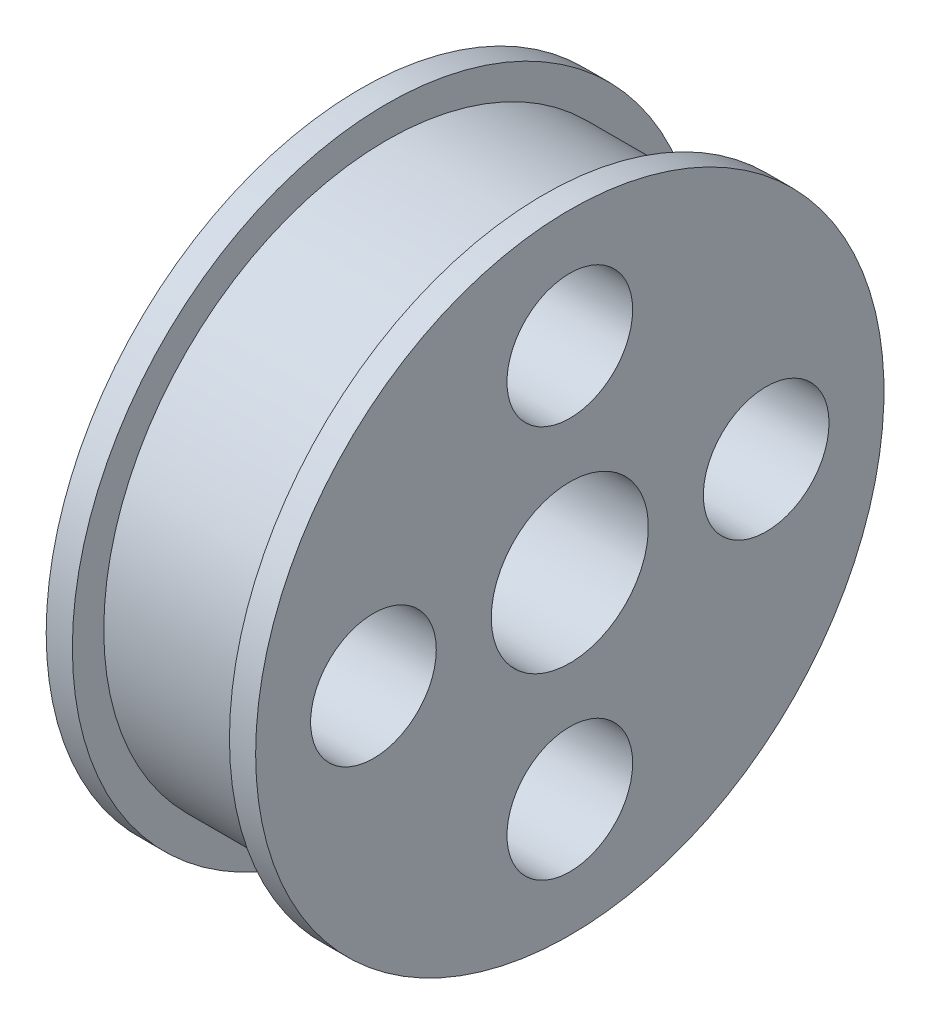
from build123d import *

# Parameters (mm, degrees)
SKETCH2_R          = 12
CUT_EXTRUDE1_DEPTH = 94.808315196


with BuildPart() as part:
    # Sketch1 → Revolve1 (revolve)
    with BuildSketch(Plane.XY, mode=Mode.PRIVATE) as revolve1_sk:
        Polygon((0, 15), (40, 15), (40, 60), (35, 60), (35, 54), (5, 54), (5, 60), (0, 60), align=None)
    revolve(revolve1_sk.sketch.rotate(Axis((0, 0, 0), (1, 0, 0)), 90), axis=Axis((0, 0, 0), (1, 0, 0)))

    # Sketch2 → Cut-Extrude1 (cut, through all)
    with BuildSketch(Plane(origin=(40, 0, 0), x_dir=(0, 0, -1), z_dir=(1, 0, 0))):
        with Locations((0, 37.5)):
            Circle(SKETCH2_R)
        with Locations((37.5, 0)):
            Circle(SKETCH2_R)
        with Locations((0, -37.5)):
            Circle(SKETCH2_R)
        with Locations((-37.5, 0)):
            Circle(SKETCH2_R)
    extrude(amount=-CUT_EXTRUDE1_DEPTH, mode=Mode.SUBTRACT)


solid = part.part
